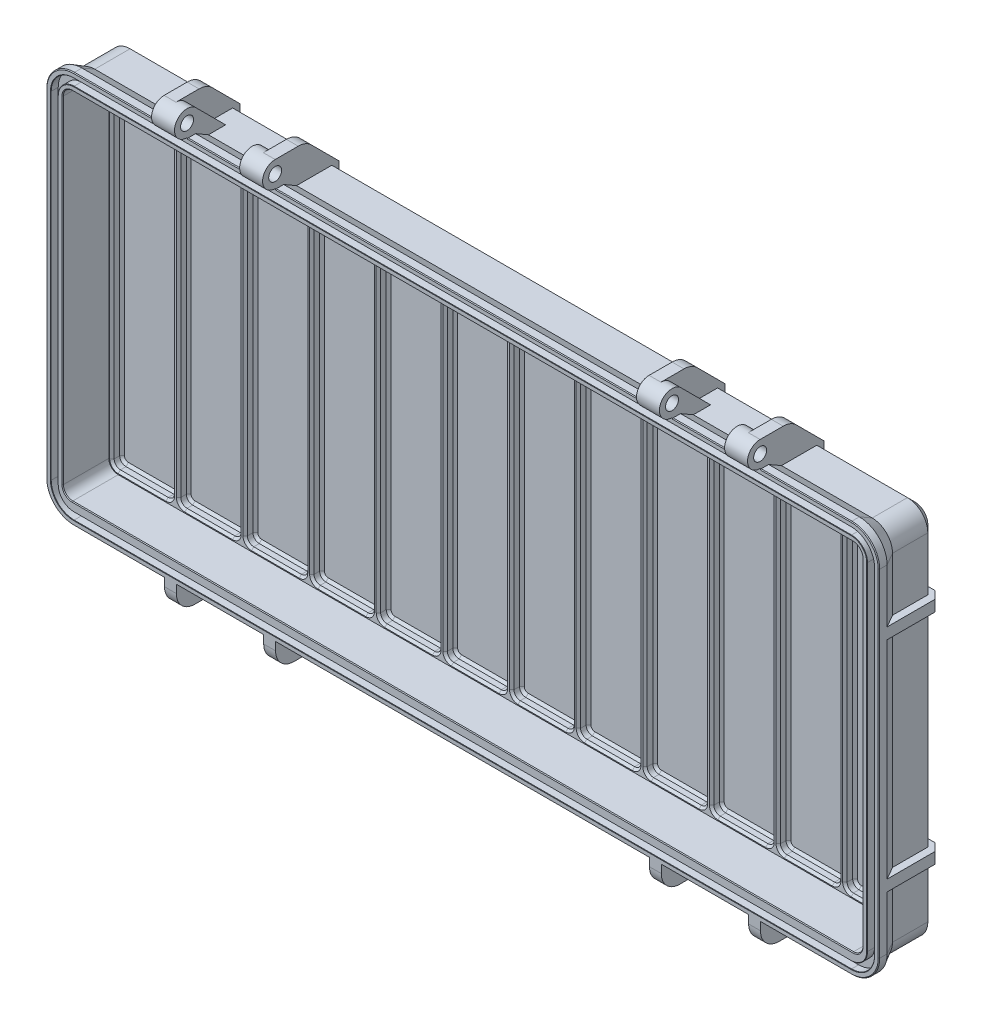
from build123d import *

# Parameters (mm, degrees)
SKETCH1_W               = 18
SKETCH1_H               = 96
BOSS_EXTRUDE1_DEPTH     = 2.75
CUT_EXTRUDE1_DEPTH      = 0.65
CUT_EXTRUDE1_DRAFT      = -45
CUT_EXTRUDE2_DEPTH      = 1.5
CUT_EXTRUDE3_DEPTH      = 0.85
CUT_EXTRUDE3_DRAFT      = 45
LPATTERN1_COUNT         = 12
LPATTERN1_PITCH         = 18
BOSS_EXTRUDE3_DEPTH     = 2
BOSS_EXTRUDE3_TAPER     = 45
BOSS_EXTRUDE5_DEPTH     = 13
BOSS_EXTRUDE6_DEPTH     = 4
BOSS_EXTRUDE6_DRAFT     = -30
BOSS_EXTRUDE7_DEPTH     = 2.2
CUT_EXTRUDE4_DEPTH      = 2
CHAMFER1_SIZE           = 0.2
CHAMFER2_SIZE           = 0.1
SKETCH14_R              = 1.75
BOSS_EXTRUDE9_DEPTH     = 3.2
SKETCH15_R              = 1.75
BOSS_EXTRUDE10_DEPTH    = 3
MIRROR2_COPY_1_SKETCH_R = 1.75
MIRROR2_COPY_1_DEPTH    = 3.2
MIRROR2_COPY_2_SKETCH_R = 1.75
MIRROR2_COPY_2_DEPTH    = 3
MIRROR2_COPY_3_SKETCH_R = 1.75
MIRROR2_COPY_3_DEPTH    = 3.2
MIRROR2_COPY_4_SKETCH_R = 1.75
MIRROR2_COPY_4_DEPTH    = 3
BOSS_EXTRUDE12_DEPTH    = 3
LPATTERN3_COUNT         = 2
LPATTERN3_PITCH         = 59
SKETCH19_R              = 1.75
BOSS_EXTRUDE13_DEPTH    = 3.2
MIRROR4_COPY_1_SKETCH_R = 1.75
MIRROR4_COPY_1_DEPTH    = 3.2


with BuildPart() as part:
    # Sketch1 → Boss-Extrude1 (new body)
    with BuildSketch(Plane.XY):
        Rectangle(SKETCH1_W, SKETCH1_H)
    extrude(amount=BOSS_EXTRUDE1_DEPTH)


with BuildPart() as cut_extrude1_tool:
    # Sketch2 → Cut-Extrude1 (with draft: the straight prism first)
    with BuildSketch(Plane.XY):
        with BuildLine():
            ThreePointArc((-6.45, 46.5), (-7.192462, 46.192462), (-7.5, 45.45))
            Line((-7.5, 45.45), (-7.5, -45.45))
            ThreePointArc((-7.5, -45.45), (-7.192462, -46.192462), (-6.45, -46.5))
            Line((-6.45, -46.5), (6.45, -46.5))
            ThreePointArc((6.45, -46.5), (7.192462, -46.192462), (7.5, -45.45))
            Line((7.5, -45.45), (7.5, 45.45))
            ThreePointArc((7.5, 45.45), (7.192462, 46.192462), (6.45, 46.5))
            Line((6.45, 46.5), (-6.45, 46.5))
        make_face()
    extrude(amount=CUT_EXTRUDE1_DEPTH)
    # Cut-Extrude1: the draft: its side faces are tilted about the plane it starts from
    cut_extrude1_sides = [cut_extrude1_tool.faces().sort_by_distance(p)[0] for p in [
        (7.192462, 46.192462, 0.325),
        (0, 46.5, 0.325),
        (-7.192462, 46.192462, 0.325),
        (-7.5, 0, 0.325),
        (-7.192462, -46.192462, 0.325),
        (0, -46.5, 0.325),
        (7.192462, -46.192462, 0.325),
        (7.5, 0, 0.325),
    ]]
    draft(cut_extrude1_sides, Plane.XY, CUT_EXTRUDE1_DRAFT)


with BuildPart() as part_1:
    add(part.part)

    # Cut-Extrude1: cut by cut_extrude1_tool
    add(cut_extrude1_tool.part, mode=Mode.SUBTRACT)

    # Sketch4 → Cut-Extrude2 (cut)
    with BuildSketch(Plane(origin=(0, 0, 0.65), x_dir=(-1, 0, 0), z_dir=(0, 0, -1))):
        with BuildLine():
            Line((8.15, -45.45), (8.15, 45.45))
            ThreePointArc((8.15, 45.45), (7.652082, 46.652082), (6.45, 47.15))
            Line((6.45, 47.15), (-6.45, 47.15))
            ThreePointArc((-6.45, 47.15), (-7.652082, 46.652082), (-8.15, 45.45))
            Line((-8.15, 45.45), (-8.15, -45.45))
            ThreePointArc((-8.15, -45.45), (-7.652082, -46.652082), (-6.45, -47.15))
            Line((-6.45, -47.15), (6.45, -47.15))
            ThreePointArc((6.45, -47.15), (7.652082, -46.652082), (8.15, -45.45))
        make_face()
    extrude(amount=-CUT_EXTRUDE2_DEPTH, mode=Mode.SUBTRACT)


with BuildPart() as cut_extrude3_tool:
    # Sketch5 → Cut-Extrude3 (with draft: the straight prism first)
    with BuildSketch(Plane(origin=(0, 0, 2.15), x_dir=(-1, 0, 0), z_dir=(0, 0, -1))):
        with BuildLine():
            Line((8.15, -45.45), (8.15, 45.45))
            ThreePointArc((8.15, 45.45), (7.652082, 46.652082), (6.45, 47.15))
            Line((6.45, 47.15), (-6.45, 47.15))
            ThreePointArc((-6.45, 47.15), (-7.652082, 46.652082), (-8.15, 45.45))
            Line((-8.15, 45.45), (-8.15, -45.45))
            ThreePointArc((-8.15, -45.45), (-7.652082, -46.652082), (-6.45, -47.15))
            Line((-6.45, -47.15), (6.45, -47.15))
            ThreePointArc((6.45, -47.15), (7.652082, -46.652082), (8.15, -45.45))
        make_face()
    extrude(amount=-CUT_EXTRUDE3_DEPTH)
    # Cut-Extrude3: the draft: its side faces are tilted about the plane it starts from
    cut_extrude3_sides = [cut_extrude3_tool.faces().sort_by_distance(p)[0] for p in [
        (-8.15, 0, 2.575),
        (-7.652082, 46.652082, 2.575),
        (0, 47.15, 2.575),
        (7.652082, 46.652082, 2.575),
        (8.15, 0, 2.575),
        (7.652082, -46.652082, 2.575),
        (0, -47.15, 2.575),
        (-7.652082, -46.652082, 2.575),
    ]]
    draft(cut_extrude3_sides, Plane(origin=(0, 0, 2.15), x_dir=(-1, 0, 0), z_dir=(0, 0, -1)), CUT_EXTRUDE3_DRAFT)


with BuildPart() as part_2:
    add(part_1.part)

    # Cut-Extrude3: cut by cut_extrude3_tool
    add(cut_extrude3_tool.part, mode=Mode.SUBTRACT)

    # LPattern1: part ×12


with BuildPart() as part_3:
    add(part_2.part)
    with Locations(*[(i * LPATTERN1_PITCH, 0, 0) for i in range(1, LPATTERN1_COUNT)]):
        add(part_2.part)

    # Sketch6 → Boss-Extrude3 (add)
    with BuildSketch(Plane(origin=(0, 0, 0), x_dir=(-1, 0, 0), z_dir=(0, 0, -1))):
        with BuildLine():
            ThreePointArc((6, -51.5), (9.889087, -49.889087), (11.5, -46))
            Line((11.5, -46), (11.5, 45))
            ThreePointArc((11.5, 45), (9.889087, 48.889087), (6, 50.5))
            Line((6, 50.5), (-204, 50.5))
            ThreePointArc((-204, 50.5), (-207.889087, 48.889087), (-209.5, 45))
            Line((-209.5, 45), (-209.5, -46))
            ThreePointArc((-209.5, -46), (-207.889087, -49.889087), (-204, -51.5))
            Line((-204, -51.5), (6, -51.5))
        make_face()
    extrude(amount=BOSS_EXTRUDE3_DEPTH, taper=BOSS_EXTRUDE3_TAPER)

    # Sketch9 → Boss-Extrude5 (add)
    with BuildSketch(Plane.XY):
        with BuildLine():
            Line((209.5, 45), (209.5, -46))
            ThreePointArc((209.5, -46), (207.889087, -49.889087), (204, -51.5))
            Line((204, -51.5), (-6, -51.5))
            ThreePointArc((-6, -51.5), (-9.889087, -49.889087), (-11.5, -46))
            Line((-11.5, -46), (-11.5, 45))
            ThreePointArc((-11.5, 45), (-9.889087, 48.889087), (-6, 50.5))
            Line((-6, 50.5), (204, 50.5))
            ThreePointArc((204, 50.5), (207.889087, 48.889087), (209.5, 45))
        make_face()
        with BuildLine():
            Line((-6.45, -48), (204.45, -48))
            ThreePointArc((204.45, -48), (206.253122, -47.253122), (207, -45.45))
            Line((207, -45.45), (207, 45.45))
            ThreePointArc((207, 45.45), (206.253122, 47.253122), (204.45, 48))
            Line((204.45, 48), (-6.45, 48))
            ThreePointArc((-6.45, 48), (-8.253122, 47.253122), (-9, 45.45))
            Line((-9, 45.45), (-9, -45.45))
            ThreePointArc((-9, -45.45), (-8.253122, -47.253122), (-6.45, -48))
        make_face(mode=Mode.SUBTRACT)
    extrude(amount=BOSS_EXTRUDE5_DEPTH)


with BuildPart() as boss_extrude6_tool:
    # Sketch10 → Boss-Extrude6 (with draft: the straight prism first)
    with BuildSketch(Plane.XY.offset(13)):
        with BuildLine():
            Line((204, 52.5), (-6, 52.5))
            ThreePointArc((-6, 52.5), (-11.303301, 50.303301), (-13.5, 45))
            Line((-13.5, 45), (-13.5, -46))
            ThreePointArc((-13.5, -46), (-11.303301, -51.303301), (-6, -53.5))
            Line((-6, -53.5), (204, -53.5))
            ThreePointArc((204, -53.5), (209.303301, -51.303301), (211.5, -46))
            Line((211.5, -46), (211.5, 45))
            ThreePointArc((211.5, 45), (209.303301, 50.303301), (204, 52.5))
        make_face()
        with BuildLine():
            Line((204.45, -48), (-6.45, -48))
            ThreePointArc((-6.45, -48), (-8.253122, -47.253122), (-9, -45.45))
            Line((-9, -45.45), (-9, 45.45))
            ThreePointArc((-9, 45.45), (-8.253122, 47.253122), (-6.45, 48))
            Line((-6.45, 48), (204.45, 48))
            ThreePointArc((204.45, 48), (206.253122, 47.253122), (207, 45.45))
            Line((207, 45.45), (207, -45.45))
            ThreePointArc((207, -45.45), (206.253122, -47.253122), (204.45, -48))
        make_face(mode=Mode.SUBTRACT)
    extrude(amount=-BOSS_EXTRUDE6_DEPTH)
    # Boss-Extrude6: the draft: its side faces are tilted about the plane it starts from
    boss_extrude6_sides = [boss_extrude6_tool.faces().sort_by_distance(p)[0] for p in [
        (99, 52.5, 11),
        (-11.303301, 50.303301, 11),
        (-13.5, -0.5, 11),
        (-11.303301, -51.303301, 11),
        (99, -53.5, 11),
        (209.303301, -51.303301, 11),
        (211.5, -0.5, 11),
        (209.303301, 50.303301, 11),
        (99, -48, 11),
        (-8.253122, -47.253122, 11),
        (-9, 0, 11),
        (-8.253122, 47.253122, 11),
        (99, 48, 11),
        (206.253122, 47.253122, 11),
        (207, 0, 11),
        (206.253122, -47.253122, 11),
    ]]
    draft(boss_extrude6_sides, Plane.XY.offset(13), BOSS_EXTRUDE6_DRAFT)


with BuildPart() as part_4:
    add(part_3.part)

    # Boss-Extrude6: add boss_extrude6_tool
    add(boss_extrude6_tool.part)

    # Sketch11 → Boss-Extrude7 (add)
    with BuildSketch(Plane.XY.offset(13)):
        with BuildLine():
            Line((204, 52.5), (-6, 52.5))
            ThreePointArc((-6, 52.5), (-11.303301, 50.303301), (-13.5, 45))
            Line((-13.5, 45), (-13.5, -46))
            ThreePointArc((-13.5, -46), (-11.303301, -51.303301), (-6, -53.5))
            Line((-6, -53.5), (204, -53.5))
            ThreePointArc((204, -53.5), (209.303301, -51.303301), (211.5, -46))
            Line((211.5, -46), (211.5, 45))
            ThreePointArc((211.5, 45), (209.303301, 50.303301), (204, 52.5))
        make_face()
        with BuildLine():
            Line((-6.45, -48), (204.45, -48))
            ThreePointArc((204.45, -48), (206.253122, -47.253122), (207, -45.45))
            Line((207, -45.45), (207, 45.45))
            ThreePointArc((207, 45.45), (206.253122, 47.253122), (204.45, 48))
            Line((204.45, 48), (-6.45, 48))
            ThreePointArc((-6.45, 48), (-8.253122, 47.253122), (-9, 45.45))
            Line((-9, 45.45), (-9, -45.45))
            ThreePointArc((-9, -45.45), (-8.253122, -47.253122), (-6.45, -48))
        make_face(mode=Mode.SUBTRACT)
    extrude(amount=BOSS_EXTRUDE7_DEPTH)

    # Sketch12 → Cut-Extrude4 (cut)
    with BuildSketch(Plane.XY.offset(15.2)):
        with BuildLine():
            Line((210.2, -46), (210.2, 45))
            ThreePointArc((210.2, 45), (208.384062, 49.384062), (204, 51.2))
            Line((204, 51.2), (-6, 51.2))
            ThreePointArc((-6, 51.2), (-10.384062, 49.384062), (-12.2, 45))
            Line((-12.2, 45), (-12.2, -46))
            ThreePointArc((-12.2, -46), (-10.384062, -50.384062), (-6, -52.2))
            Line((-6, -52.2), (204, -52.2))
            ThreePointArc((204, -52.2), (208.384062, -50.384062), (210.2, -46))
        make_face()
        with BuildLine():
            Line((208.3, -46), (208.3, 45))
            ThreePointArc((208.3, 45), (207.040559, 48.040559), (204, 49.3))
            Line((204, 49.3), (-6, 49.3))
            ThreePointArc((-6, 49.3), (-9.040559, 48.040559), (-10.3, 45))
            Line((-10.3, 45), (-10.3, -46))
            ThreePointArc((-10.3, -46), (-9.040559, -49.040559), (-6, -50.3))
            Line((-6, -50.3), (204, -50.3))
            ThreePointArc((204, -50.3), (207.040559, -49.040559), (208.3, -46))
        make_face(mode=Mode.SUBTRACT)
    extrude(amount=-CUT_EXTRUDE4_DEPTH, mode=Mode.SUBTRACT)

    # Chamfer1
    chamfer1_edges = [part_4.edges().sort_by_distance(p)[0] for p in [
        (209.303301, 50.303301, 15.2),
        (99, 52.5, 15.2),
        (-11.303301, 50.303301, 15.2),
        (-13.5, -0.5, 15.2),
        (-11.303301, -51.303301, 15.2),
        (99, -53.5, 15.2),
        (209.303301, -51.303301, 15.2),
        (211.5, -0.5, 15.2),
        (-8.253122, -47.253122, 15.2),
        (99, -48, 15.2),
        (206.253122, -47.253122, 15.2),
        (207, 0, 15.2),
        (206.253122, 47.253122, 15.2),
        (99, 48, 15.2),
        (-8.253122, 47.253122, 15.2),
        (-9, 0, 15.2),
    ]]
    chamfer(chamfer1_edges, length=CHAMFER1_SIZE)

    # Chamfer2
    chamfer2_edges = [part_4.edges().sort_by_distance(p)[0] for p in [
        (208.384062, 49.384062, 15.2),
        (99, 51.2, 15.2),
        (-10.384062, 49.384062, 15.2),
        (-12.2, -0.5, 15.2),
        (-10.384062, -50.384062, 15.2),
        (99, -52.2, 15.2),
        (208.384062, -50.384062, 15.2),
        (210.2, -0.5, 15.2),
        (207.040559, -49.040559, 15.2),
        (99, -50.3, 15.2),
        (-9.040559, -49.040559, 15.2),
        (-10.3, -0.5, 15.2),
        (-9.040559, 48.040559, 15.2),
        (99, 49.3, 15.2),
        (207.040559, 48.040559, 15.2),
        (208.3, -0.5, 15.2),
    ]]
    chamfer(chamfer2_edges, length=CHAMFER2_SIZE)

    # Sketch14 → Boss-Extrude9 (add)
    with BuildSketch(Plane.ZY.offset(-18.5)):
        with BuildLine():
            Line((15.3, 52.7), (15.2, 52.6))
            Line((15.2, 52.6), (15.2, 52.3))
            Line((15.2, 52.3), (15, 52.5))
            Line((15, 52.5), (13, 52.5))
            Line((13, 52.5), (9.535898, 50.5))
            Line((9.535898, 50.5), (0, 50.5))
            Line((0, 50.5), (-2, 48.5))
            Line((-2, 48.5), (-2, 50.5))
            Line((-2, 50.5), (5.535534, 58.035534))
            ThreePointArc((5.535534, 58.035534), (7.157651, 59.119398), (9.071068, 59.5))
            Line((9.071068, 59.5), (15.3, 59.5))
            ThreePointArc((15.3, 59.5), (18.7, 56.1), (15.3, 52.7))
        make_face()
        with Locations(Location((15.3, 56.1, 0), (0, 0, 270))):
            Circle(SKETCH14_R, mode=Mode.SUBTRACT)
    boss_extrude9 = extrude(amount=-BOSS_EXTRUDE9_DEPTH)

    # Sketch15 → Boss-Extrude10 (add)
    with BuildSketch(Plane(origin=(21.7, 0, 0), x_dir=(0, 0, -1), z_dir=(1, 0, 0))):
        with BuildLine():
            Line((-15.2, 52.6), (-15.3, 52.7))
            ThreePointArc((-15.3, 52.7), (-18.44119, 57.401124), (-12.895837, 58.504163))
            Line((-12.895837, 58.504163), (-4.891674, 50.5))
            Line((-4.891674, 50.5), (-9.535898, 50.5))
            Line((-9.535898, 50.5), (-13, 52.5))
            Line((-13, 52.5), (-15, 52.5))
            Line((-15, 52.5), (-15.2, 52.3))
            Line((-15.2, 52.3), (-15.2, 52.6))
        make_face()
        with Locations(Location((-15.3, 56.1, 0), (0, 0, 270))):
            Circle(SKETCH15_R, mode=Mode.SUBTRACT)
    boss_extrude10 = extrude(amount=BOSS_EXTRUDE10_DEPTH)

    # Mirror1: Boss-Extrude9, Boss-Extrude10 across plane
    add(boss_extrude9.mirror(Plane.ZY.offset(-33.5)))
    add(boss_extrude10.mirror(Plane.ZY.offset(-33.5)))

    # Mirror2 copy 1 sketch → Mirror2 copy 1 (add)
    with BuildSketch(Plane.ZY.offset(-149.5)):
        with BuildLine():
            Line((15.3, 52.7), (15.2, 52.6))
            Line((15.2, 52.6), (15.2, 52.3))
            Line((15.2, 52.3), (15, 52.5))
            Line((15, 52.5), (13, 52.5))
            Line((13, 52.5), (9.535898, 50.5))
            Line((9.535898, 50.5), (0, 50.5))
            Line((0, 50.5), (-2, 48.5))
            Line((-2, 48.5), (-2, 50.5))
            Line((-2, 50.5), (5.535534, 58.035534))
            ThreePointArc((5.535534, 58.035534), (7.157651, 59.119398), (9.071068, 59.5))
            Line((9.071068, 59.5), (15.3, 59.5))
            ThreePointArc((15.3, 59.5), (18.7, 56.1), (15.3, 52.7))
        make_face()
        with Locations(Location((15.3, 56.1, 0), (0, 0, 270))):
            Circle(MIRROR2_COPY_1_SKETCH_R, mode=Mode.SUBTRACT)
    extrude(amount=-MIRROR2_COPY_1_DEPTH)

    # Mirror2 copy 2 sketch → Mirror2 copy 2 (add)
    with BuildSketch(Plane(origin=(152.7, 0, 0), x_dir=(0, 0, -1), z_dir=(1, 0, 0))):
        with BuildLine():
            Line((-15.2, 52.6), (-15.3, 52.7))
            ThreePointArc((-15.3, 52.7), (-18.44119, 57.401124), (-12.895837, 58.504163))
            Line((-12.895837, 58.504163), (-4.891674, 50.5))
            Line((-4.891674, 50.5), (-9.535898, 50.5))
            Line((-9.535898, 50.5), (-13, 52.5))
            Line((-13, 52.5), (-15, 52.5))
            Line((-15, 52.5), (-15.2, 52.3))
            Line((-15.2, 52.3), (-15.2, 52.6))
        make_face()
        with Locations(Location((-15.3, 56.1, 0), (0, 0, 270))):
            Circle(MIRROR2_COPY_2_SKETCH_R, mode=Mode.SUBTRACT)
    extrude(amount=MIRROR2_COPY_2_DEPTH)

    # Mirror2 copy 3 sketch → Mirror2 copy 3 (add)
    with BuildSketch(Plane(origin=(179.5, 0, 0), x_dir=(0, 0, 1), z_dir=(1, 0, 0))):
        with BuildLine():
            Line((15.3, -52.7), (15.2, -52.6))
            Line((15.2, -52.6), (15.2, -52.3))
            Line((15.2, -52.3), (15, -52.5))
            Line((15, -52.5), (13, -52.5))
            Line((13, -52.5), (9.535898, -50.5))
            Line((9.535898, -50.5), (0, -50.5))
            Line((0, -50.5), (-2, -48.5))
            Line((-2, -48.5), (-2, -50.5))
            Line((-2, -50.5), (5.535534, -58.035534))
            ThreePointArc((5.535534, -58.035534), (7.157651, -59.119398), (9.071068, -59.5))
            Line((9.071068, -59.5), (15.3, -59.5))
            ThreePointArc((15.3, -59.5), (18.7, -56.1), (15.3, -52.7))
        make_face()
        with Locations((15.3, -56.1)):
            Circle(MIRROR2_COPY_3_SKETCH_R, mode=Mode.SUBTRACT)
    extrude(amount=-MIRROR2_COPY_3_DEPTH)

    # Mirror2 copy 4 sketch → Mirror2 copy 4 (add)
    with BuildSketch(Plane(origin=(176.3, 0, 0), x_dir=(0, 0, -1), z_dir=(-1, 0, 0))):
        with BuildLine():
            Line((-15.2, -52.6), (-15.3, -52.7))
            ThreePointArc((-15.3, -52.7), (-18.44119, -57.401124), (-12.895837, -58.504163))
            Line((-12.895837, -58.504163), (-4.891674, -50.5))
            Line((-4.891674, -50.5), (-9.535898, -50.5))
            Line((-9.535898, -50.5), (-13, -52.5))
            Line((-13, -52.5), (-15, -52.5))
            Line((-15, -52.5), (-15.2, -52.3))
            Line((-15.2, -52.3), (-15.2, -52.6))
        make_face()
        with Locations((-15.3, -56.1)):
            Circle(MIRROR2_COPY_4_SKETCH_R, mode=Mode.SUBTRACT)
    extrude(amount=MIRROR2_COPY_4_DEPTH)

    # Sketch18 → Boss-Extrude12 (add)
    with BuildSketch(Plane(origin=(0, -31.5, 0), x_dir=(-1, 0, 0), z_dir=(0, -1, 0))):
        Polygon((9.5, 2), (11.5, 0), (11.5, -9.535898), (13.5, -13), (13.5, 0), (11.5, 2), align=None)
        Polygon((-207.5, 2), (-209.5, 0), (-209.5, -9.535898), (-211.5, -13), (-211.5, 0), (-209.5, 2), align=None)
    boss_extrude12 = extrude(amount=-BOSS_EXTRUDE12_DEPTH)

    # LPattern3: Boss-Extrude12 ×2
    with Locations(*[(0, i * LPATTERN3_PITCH, 0) for i in range(1, LPATTERN3_COUNT)]):
        add(boss_extrude12)

    # Sketch19 → Boss-Extrude13 (add)
    with BuildSketch(Plane.ZY.offset(-18.5)):
        with BuildLine():
            Line((15.2, -53.3), (15.2, -55.5))
            ThreePointArc((15.2, -55.5), (13.735534, -59.035534), (10.2, -60.5))
            Line((10.2, -60.5), (4.771068, -60.5))
            ThreePointArc((4.771068, -60.5), (2.857651, -60.119398), (1.235534, -59.035534))
            Line((1.235534, -59.035534), (-2, -55.8))
            Line((-2, -55.8), (-2, -49.5))
            Line((-2, -49.5), (0, -51.5))
            Line((0, -51.5), (9.535898, -51.5))
            Line((9.535898, -51.5), (13, -53.5))
            Line((13, -53.5), (15, -53.5))
            Line((15, -53.5), (15.2, -53.3))
        make_face()
        with Locations(Location((7.3, -55.8, 0), (0, 0, 270))):
            Circle(SKETCH19_R, mode=Mode.SUBTRACT)
    boss_extrude13 = extrude(amount=-BOSS_EXTRUDE13_DEPTH)

    # Mirror3: Boss-Extrude13 across plane
    add(boss_extrude13.mirror(Plane.ZY.offset(-33.5)))

    # Mirror4: Boss-Extrude13 across plane
    add(boss_extrude13.mirror(Plane.ZY.offset(-99)))

    # Mirror4 copy 1 sketch → Mirror4 copy 1 (add)
    with BuildSketch(Plane.ZY.offset(-149.5)):
        with BuildLine():
            Line((15.2, -53.3), (15.2, -55.5))
            ThreePointArc((15.2, -55.5), (13.735534, -59.035534), (10.2, -60.5))
            Line((10.2, -60.5), (4.771068, -60.5))
            ThreePointArc((4.771068, -60.5), (2.857651, -60.119398), (1.235534, -59.035534))
            Line((1.235534, -59.035534), (-2, -55.8))
            Line((-2, -55.8), (-2, -49.5))
            Line((-2, -49.5), (0, -51.5))
            Line((0, -51.5), (9.535898, -51.5))
            Line((9.535898, -51.5), (13, -53.5))
            Line((13, -53.5), (15, -53.5))
            Line((15, -53.5), (15.2, -53.3))
        make_face()
        with Locations(Location((7.3, -55.8, 0), (0, 0, 270))):
            Circle(MIRROR4_COPY_1_SKETCH_R, mode=Mode.SUBTRACT)
    extrude(amount=-MIRROR4_COPY_1_DEPTH)


solid = part_4.part
